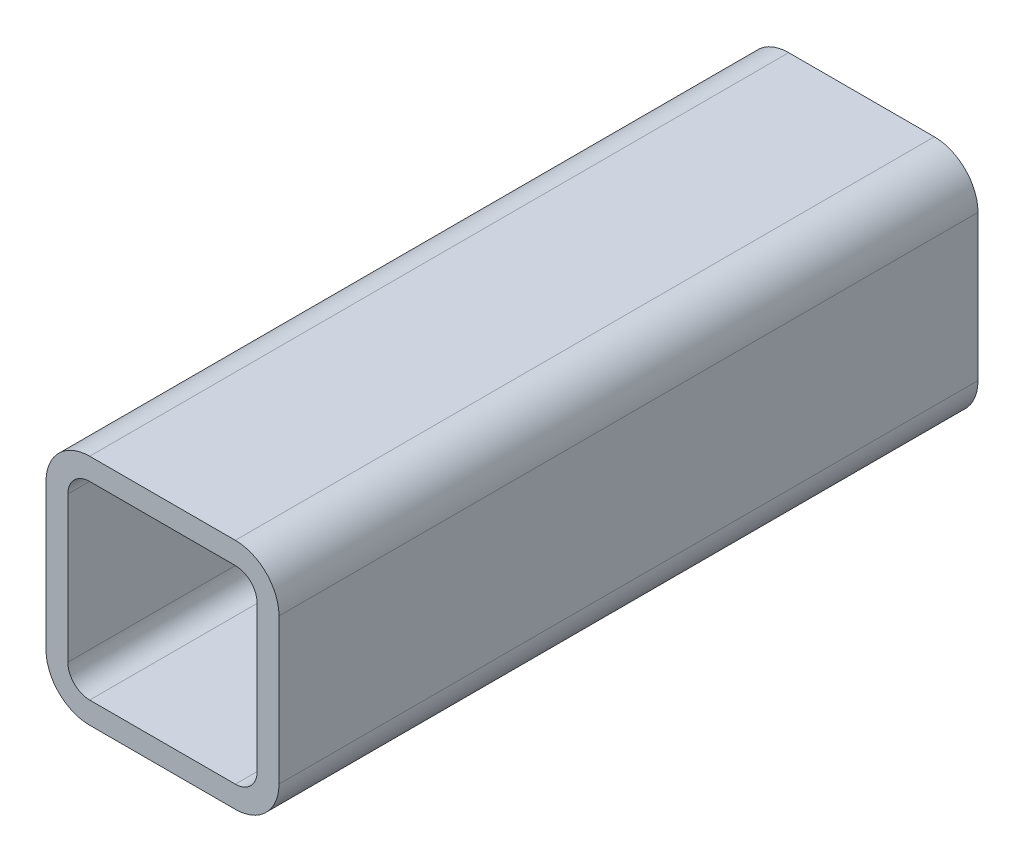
ISO-10303-21;
HEADER;
FILE_DESCRIPTION(('STEP AP214'),'2;1');
FILE_NAME('part.step','',(''),(''),'','','');
FILE_SCHEMA(('AUTOMOTIVE_DESIGN { 1 0 10303 214 1 1 1 1 }'));
ENDSEC;
DATA;
#1=APPLICATION_CONTEXT('core data for automotive mechanical design processes');
#2=APPLICATION_PROTOCOL_DEFINITION('international standard','automotive_design',2000,#1);
#3=PRODUCT_CONTEXT('',#1,'mechanical');
#4=PRODUCT('Part','Part','',(#3));
#5=PRODUCT_RELATED_PRODUCT_CATEGORY('part','',(#4));
#6=PRODUCT_DEFINITION_FORMATION('','',#4);
#7=PRODUCT_DEFINITION_CONTEXT('part definition',#1,'design');
#8=PRODUCT_DEFINITION('design','',#6,#7);
#9=PRODUCT_DEFINITION_SHAPE('','',#8);
#10=(LENGTH_UNIT() NAMED_UNIT(*) SI_UNIT(.MILLI.,.METRE.));
#11=(NAMED_UNIT(*) PLANE_ANGLE_UNIT() SI_UNIT($,.RADIAN.));
#12=(NAMED_UNIT(*) SI_UNIT($,.STERADIAN.) SOLID_ANGLE_UNIT());
#13=UNCERTAINTY_MEASURE_WITH_UNIT(LENGTH_MEASURE(1.E-05),#10,'distance_accuracy_value','');
#14=(GEOMETRIC_REPRESENTATION_CONTEXT(3) GLOBAL_UNCERTAINTY_ASSIGNED_CONTEXT((#13)) GLOBAL_UNIT_ASSIGNED_CONTEXT((#10,
#11,#12)) REPRESENTATION_CONTEXT('',''));
#15=CARTESIAN_POINT('',(0.,0.,0.));
#16=DIRECTION('',(0.,0.,1.));
#17=DIRECTION('',(1.,0.,0.));
#18=AXIS2_PLACEMENT_3D('',#15,#16,#17);
#19=CARTESIAN_POINT('',(20.7251778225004,84.6077651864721,304.8));
#20=DIRECTION('',(0.,0.,1.));
#21=DIRECTION('',(1.,0.,0.));
#22=AXIS2_PLACEMENT_3D('',#19,#20,#21);
#23=PLANE('',#22);
#24=CARTESIAN_POINT('',(20.7251778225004,84.6077651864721,304.8));
#25=DIRECTION('',(0.,0.,1.));
#26=DIRECTION('',(1.,0.,0.));
#27=AXIS2_PLACEMENT_3D('',#24,#25,#26);
#28=CIRCLE('',#27,19.05);
#29=CARTESIAN_POINT('',(20.7251778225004,103.657765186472,304.8));
#30=VERTEX_POINT('',#29);
#31=CARTESIAN_POINT('',(1.67517782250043,84.6077651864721,304.8));
#32=VERTEX_POINT('',#31);
#33=EDGE_CURVE('E211',#30,#32,#28,.T.);
#34=ORIENTED_EDGE('',*,*,#33,.T.);
#35=DIRECTION('',(0.,-1.,0.));
#36=VECTOR('',#35,1.);
#37=CARTESIAN_POINT('',(1.67517782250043,21.1077651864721,304.8));
#38=LINE('',#37,#36);
#39=CARTESIAN_POINT('',(1.67517782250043,21.1077651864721,304.8));
#40=VERTEX_POINT('',#39);
#41=EDGE_CURVE('E214',#32,#40,#38,.T.);
#42=ORIENTED_EDGE('',*,*,#41,.T.);
#43=CARTESIAN_POINT('',(20.7251778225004,21.1077651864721,304.8));
#44=DIRECTION('',(0.,0.,1.));
#45=DIRECTION('',(1.,0.,0.));
#46=AXIS2_PLACEMENT_3D('',#43,#44,#45);
#47=CIRCLE('',#46,19.05);
#48=CARTESIAN_POINT('',(20.7251778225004,2.05776518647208,304.8));
#49=VERTEX_POINT('',#48);
#50=EDGE_CURVE('E217',#40,#49,#47,.T.);
#51=ORIENTED_EDGE('',*,*,#50,.T.);
#52=DIRECTION('',(1.,0.,0.));
#53=VECTOR('',#52,1.);
#54=CARTESIAN_POINT('',(84.2251778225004,2.05776518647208,304.8));
#55=LINE('',#54,#53);
#56=CARTESIAN_POINT('',(84.2251778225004,2.05776518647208,304.8));
#57=VERTEX_POINT('',#56);
#58=EDGE_CURVE('E219',#49,#57,#55,.T.);
#59=ORIENTED_EDGE('',*,*,#58,.T.);
#60=CARTESIAN_POINT('',(84.2251778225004,21.1077651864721,304.8));
#61=DIRECTION('',(0.,0.,1.));
#62=DIRECTION('',(1.,0.,0.));
#63=AXIS2_PLACEMENT_3D('',#60,#61,#62);
#64=CIRCLE('',#63,19.05);
#65=CARTESIAN_POINT('',(103.2751778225,21.1077651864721,304.8));
#66=VERTEX_POINT('',#65);
#67=EDGE_CURVE('E221',#57,#66,#64,.T.);
#68=ORIENTED_EDGE('',*,*,#67,.T.);
#69=DIRECTION('',(0.,1.,0.));
#70=VECTOR('',#69,1.);
#71=CARTESIAN_POINT('',(103.2751778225,84.6077651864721,304.8));
#72=LINE('',#71,#70);
#73=CARTESIAN_POINT('',(103.2751778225,84.6077651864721,304.8));
#74=VERTEX_POINT('',#73);
#75=EDGE_CURVE('E223',#66,#74,#72,.T.);
#76=ORIENTED_EDGE('',*,*,#75,.T.);
#77=CARTESIAN_POINT('',(84.2251778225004,84.6077651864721,304.8));
#78=DIRECTION('',(0.,0.,1.));
#79=DIRECTION('',(1.,0.,0.));
#80=AXIS2_PLACEMENT_3D('',#77,#78,#79);
#81=CIRCLE('',#80,19.05);
#82=CARTESIAN_POINT('',(84.2251778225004,103.657765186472,304.8));
#83=VERTEX_POINT('',#82);
#84=EDGE_CURVE('E225',#74,#83,#81,.T.);
#85=ORIENTED_EDGE('',*,*,#84,.T.);
#86=DIRECTION('',(-1.,0.,0.));
#87=VECTOR('',#86,1.);
#88=CARTESIAN_POINT('',(20.7251778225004,103.657765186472,304.8));
#89=LINE('',#88,#87);
#90=EDGE_CURVE('E227',#83,#30,#89,.T.);
#91=ORIENTED_EDGE('',*,*,#90,.T.);
#92=EDGE_LOOP('',(#34,#42,#51,#59,#68,#76,#85,#91));
#93=FACE_BOUND('',#92,.T.);
#94=DIRECTION('',(0.,-1.,0.));
#95=VECTOR('',#94,1.);
#96=CARTESIAN_POINT('',(11.2001778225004,21.1077651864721,304.8));
#97=LINE('',#96,#95);
#98=CARTESIAN_POINT('',(11.2001778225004,84.6077651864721,304.8));
#99=VERTEX_POINT('',#98);
#100=CARTESIAN_POINT('',(11.2001778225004,21.1077651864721,304.8));
#101=VERTEX_POINT('',#100);
#102=EDGE_CURVE('E154',#99,#101,#97,.T.);
#103=ORIENTED_EDGE('',*,*,#102,.F.);
#104=CARTESIAN_POINT('',(20.7251778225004,84.6077651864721,304.8));
#105=DIRECTION('',(0.,0.,1.));
#106=DIRECTION('',(1.,0.,0.));
#107=AXIS2_PLACEMENT_3D('',#104,#105,#106);
#108=CIRCLE('',#107,9.52500000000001);
#109=CARTESIAN_POINT('',(20.7251778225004,94.1327651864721,304.8));
#110=VERTEX_POINT('',#109);
#111=EDGE_CURVE('E146',#110,#99,#108,.T.);
#112=ORIENTED_EDGE('',*,*,#111,.F.);
#113=DIRECTION('',(-1.,0.,0.));
#114=VECTOR('',#113,1.);
#115=CARTESIAN_POINT('',(20.7251778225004,94.1327651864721,304.8));
#116=LINE('',#115,#114);
#117=CARTESIAN_POINT('',(84.2251778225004,94.1327651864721,304.8));
#118=VERTEX_POINT('',#117);
#119=EDGE_CURVE('E179',#118,#110,#116,.T.);
#120=ORIENTED_EDGE('',*,*,#119,.F.);
#121=CARTESIAN_POINT('',(84.2251778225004,84.6077651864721,304.8));
#122=DIRECTION('',(0.,0.,1.));
#123=DIRECTION('',(1.,0.,0.));
#124=AXIS2_PLACEMENT_3D('',#121,#122,#123);
#125=CIRCLE('',#124,9.52500000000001);
#126=CARTESIAN_POINT('',(93.7501778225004,84.6077651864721,304.8));
#127=VERTEX_POINT('',#126);
#128=EDGE_CURVE('E177',#127,#118,#125,.T.);
#129=ORIENTED_EDGE('',*,*,#128,.F.);
#130=DIRECTION('',(0.,1.,0.));
#131=VECTOR('',#130,1.);
#132=CARTESIAN_POINT('',(93.7501778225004,84.6077651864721,304.8));
#133=LINE('',#132,#131);
#134=CARTESIAN_POINT('',(93.7501778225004,21.1077651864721,304.8));
#135=VERTEX_POINT('',#134);
#136=EDGE_CURVE('E175',#135,#127,#133,.T.);
#137=ORIENTED_EDGE('',*,*,#136,.F.);
#138=CARTESIAN_POINT('',(84.2251778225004,21.1077651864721,304.8));
#139=DIRECTION('',(0.,0.,1.));
#140=DIRECTION('',(1.,0.,0.));
#141=AXIS2_PLACEMENT_3D('',#138,#139,#140);
#142=CIRCLE('',#141,9.52500000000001);
#143=CARTESIAN_POINT('',(84.2251778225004,11.5827651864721,304.8));
#144=VERTEX_POINT('',#143);
#145=EDGE_CURVE('E173',#144,#135,#142,.T.);
#146=ORIENTED_EDGE('',*,*,#145,.F.);
#147=DIRECTION('',(1.,0.,0.));
#148=VECTOR('',#147,1.);
#149=CARTESIAN_POINT('',(84.2251778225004,11.5827651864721,304.8));
#150=LINE('',#149,#148);
#151=CARTESIAN_POINT('',(20.7251778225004,11.5827651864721,304.8));
#152=VERTEX_POINT('',#151);
#153=EDGE_CURVE('E169',#152,#144,#150,.T.);
#154=ORIENTED_EDGE('',*,*,#153,.F.);
#155=CARTESIAN_POINT('',(20.7251778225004,21.1077651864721,304.8));
#156=DIRECTION('',(0.,0.,1.));
#157=DIRECTION('',(1.,0.,0.));
#158=AXIS2_PLACEMENT_3D('',#155,#156,#157);
#159=CIRCLE('',#158,9.525);
#160=EDGE_CURVE('E167',#101,#152,#159,.T.);
#161=ORIENTED_EDGE('',*,*,#160,.F.);
#162=EDGE_LOOP('',(#103,#112,#120,#129,#137,#146,#154,#161));
#163=FACE_BOUND('',#162,.T.);
#164=ADVANCED_FACE('F33',(#93,#163),#23,.T.);
#165=CARTESIAN_POINT('',(20.7251778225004,84.6077651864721,0.));
#166=DIRECTION('',(0.,0.,1.));
#167=DIRECTION('',(1.,0.,0.));
#168=AXIS2_PLACEMENT_3D('',#165,#166,#167);
#169=PLANE('',#168);
#170=CARTESIAN_POINT('',(20.7251778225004,84.6077651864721,0.));
#171=DIRECTION('',(0.,0.,1.));
#172=DIRECTION('',(1.,0.,0.));
#173=AXIS2_PLACEMENT_3D('',#170,#171,#172);
#174=CIRCLE('',#173,19.05);
#175=CARTESIAN_POINT('',(20.7251778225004,103.657765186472,0.));
#176=VERTEX_POINT('',#175);
#177=CARTESIAN_POINT('',(1.67517782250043,84.6077651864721,0.));
#178=VERTEX_POINT('',#177);
#179=EDGE_CURVE('E162',#176,#178,#174,.T.);
#180=ORIENTED_EDGE('',*,*,#179,.F.);
#181=DIRECTION('',(-1.,0.,0.));
#182=VECTOR('',#181,1.);
#183=CARTESIAN_POINT('',(20.7251778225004,103.657765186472,0.));
#184=LINE('',#183,#182);
#185=CARTESIAN_POINT('',(84.2251778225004,103.657765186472,0.));
#186=VERTEX_POINT('',#185);
#187=EDGE_CURVE('E215',#186,#176,#184,.T.);
#188=ORIENTED_EDGE('',*,*,#187,.F.);
#189=CARTESIAN_POINT('',(84.2251778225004,84.6077651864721,0.));
#190=DIRECTION('',(0.,0.,1.));
#191=DIRECTION('',(1.,0.,0.));
#192=AXIS2_PLACEMENT_3D('',#189,#190,#191);
#193=CIRCLE('',#192,19.05);
#194=CARTESIAN_POINT('',(103.2751778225,84.6077651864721,0.));
#195=VERTEX_POINT('',#194);
#196=EDGE_CURVE('E242',#195,#186,#193,.T.);
#197=ORIENTED_EDGE('',*,*,#196,.F.);
#198=DIRECTION('',(0.,1.,0.));
#199=VECTOR('',#198,1.);
#200=CARTESIAN_POINT('',(103.2751778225,84.6077651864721,0.));
#201=LINE('',#200,#199);
#202=CARTESIAN_POINT('',(103.2751778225,21.1077651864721,0.));
#203=VERTEX_POINT('',#202);
#204=EDGE_CURVE('E240',#203,#195,#201,.T.);
#205=ORIENTED_EDGE('',*,*,#204,.F.);
#206=CARTESIAN_POINT('',(84.2251778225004,21.1077651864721,0.));
#207=DIRECTION('',(0.,0.,1.));
#208=DIRECTION('',(1.,0.,0.));
#209=AXIS2_PLACEMENT_3D('',#206,#207,#208);
#210=CIRCLE('',#209,19.05);
#211=CARTESIAN_POINT('',(84.2251778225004,2.05776518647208,0.));
#212=VERTEX_POINT('',#211);
#213=EDGE_CURVE('E238',#212,#203,#210,.T.);
#214=ORIENTED_EDGE('',*,*,#213,.F.);
#215=DIRECTION('',(1.,0.,0.));
#216=VECTOR('',#215,1.);
#217=CARTESIAN_POINT('',(84.2251778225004,2.05776518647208,0.));
#218=LINE('',#217,#216);
#219=CARTESIAN_POINT('',(20.7251778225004,2.05776518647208,0.));
#220=VERTEX_POINT('',#219);
#221=EDGE_CURVE('E236',#220,#212,#218,.T.);
#222=ORIENTED_EDGE('',*,*,#221,.F.);
#223=CARTESIAN_POINT('',(20.7251778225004,21.1077651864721,0.));
#224=DIRECTION('',(0.,0.,1.));
#225=DIRECTION('',(1.,0.,0.));
#226=AXIS2_PLACEMENT_3D('',#223,#224,#225);
#227=CIRCLE('',#226,19.05);
#228=CARTESIAN_POINT('',(1.67517782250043,21.1077651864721,0.));
#229=VERTEX_POINT('',#228);
#230=EDGE_CURVE('E234',#229,#220,#227,.T.);
#231=ORIENTED_EDGE('',*,*,#230,.F.);
#232=DIRECTION('',(0.,-1.,0.));
#233=VECTOR('',#232,1.);
#234=CARTESIAN_POINT('',(1.67517782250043,21.1077651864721,0.));
#235=LINE('',#234,#233);
#236=EDGE_CURVE('E232',#178,#229,#235,.T.);
#237=ORIENTED_EDGE('',*,*,#236,.F.);
#238=EDGE_LOOP('',(#180,#188,#197,#205,#214,#222,#231,#237));
#239=FACE_BOUND('',#238,.T.);
#240=CARTESIAN_POINT('',(20.7251778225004,84.6077651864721,0.));
#241=DIRECTION('',(0.,0.,1.));
#242=DIRECTION('',(1.,0.,0.));
#243=AXIS2_PLACEMENT_3D('',#240,#241,#242);
#244=CIRCLE('',#243,9.52500000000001);
#245=CARTESIAN_POINT('',(20.7251778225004,94.1327651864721,0.));
#246=VERTEX_POINT('',#245);
#247=CARTESIAN_POINT('',(11.2001778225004,84.6077651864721,0.));
#248=VERTEX_POINT('',#247);
#249=EDGE_CURVE('E56',#246,#248,#244,.T.);
#250=ORIENTED_EDGE('',*,*,#249,.T.);
#251=DIRECTION('',(0.,-1.,0.));
#252=VECTOR('',#251,1.);
#253=CARTESIAN_POINT('',(11.2001778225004,21.1077651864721,0.));
#254=LINE('',#253,#252);
#255=CARTESIAN_POINT('',(11.2001778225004,21.1077651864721,0.));
#256=VERTEX_POINT('',#255);
#257=EDGE_CURVE('E161',#248,#256,#254,.T.);
#258=ORIENTED_EDGE('',*,*,#257,.T.);
#259=CARTESIAN_POINT('',(20.7251778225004,21.1077651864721,0.));
#260=DIRECTION('',(0.,0.,1.));
#261=DIRECTION('',(1.,0.,0.));
#262=AXIS2_PLACEMENT_3D('',#259,#260,#261);
#263=CIRCLE('',#262,9.525);
#264=CARTESIAN_POINT('',(20.7251778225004,11.5827651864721,0.));
#265=VERTEX_POINT('',#264);
#266=EDGE_CURVE('E183',#256,#265,#263,.T.);
#267=ORIENTED_EDGE('',*,*,#266,.T.);
#268=DIRECTION('',(1.,0.,0.));
#269=VECTOR('',#268,1.);
#270=CARTESIAN_POINT('',(84.2251778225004,11.5827651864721,0.));
#271=LINE('',#270,#269);
#272=CARTESIAN_POINT('',(84.2251778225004,11.5827651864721,0.));
#273=VERTEX_POINT('',#272);
#274=EDGE_CURVE('E186',#265,#273,#271,.T.);
#275=ORIENTED_EDGE('',*,*,#274,.T.);
#276=CARTESIAN_POINT('',(84.2251778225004,21.1077651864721,0.));
#277=DIRECTION('',(0.,0.,1.));
#278=DIRECTION('',(1.,0.,0.));
#279=AXIS2_PLACEMENT_3D('',#276,#277,#278);
#280=CIRCLE('',#279,9.52500000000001);
#281=CARTESIAN_POINT('',(93.7501778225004,21.1077651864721,0.));
#282=VERTEX_POINT('',#281);
#283=EDGE_CURVE('E189',#273,#282,#280,.T.);
#284=ORIENTED_EDGE('',*,*,#283,.T.);
#285=DIRECTION('',(0.,1.,0.));
#286=VECTOR('',#285,1.);
#287=CARTESIAN_POINT('',(93.7501778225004,84.6077651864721,0.));
#288=LINE('',#287,#286);
#289=CARTESIAN_POINT('',(93.7501778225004,84.6077651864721,0.));
#290=VERTEX_POINT('',#289);
#291=EDGE_CURVE('E192',#282,#290,#288,.T.);
#292=ORIENTED_EDGE('',*,*,#291,.T.);
#293=CARTESIAN_POINT('',(84.2251778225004,84.6077651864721,0.));
#294=DIRECTION('',(0.,0.,1.));
#295=DIRECTION('',(1.,0.,0.));
#296=AXIS2_PLACEMENT_3D('',#293,#294,#295);
#297=CIRCLE('',#296,9.52500000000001);
#298=CARTESIAN_POINT('',(84.2251778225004,94.1327651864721,0.));
#299=VERTEX_POINT('',#298);
#300=EDGE_CURVE('E195',#290,#299,#297,.T.);
#301=ORIENTED_EDGE('',*,*,#300,.T.);
#302=DIRECTION('',(-1.,0.,0.));
#303=VECTOR('',#302,1.);
#304=CARTESIAN_POINT('',(20.7251778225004,94.1327651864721,0.));
#305=LINE('',#304,#303);
#306=EDGE_CURVE('E155',#299,#246,#305,.T.);
#307=ORIENTED_EDGE('',*,*,#306,.T.);
#308=EDGE_LOOP('',(#250,#258,#267,#275,#284,#292,#301,#307));
#309=FACE_BOUND('',#308,.T.);
#310=ADVANCED_FACE('F272',(#239,#309),#169,.F.);
#311=CARTESIAN_POINT('',(20.7251778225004,84.6077651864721,304.8));
#312=DIRECTION('',(0.,0.,-1.));
#313=DIRECTION('',(-1.,0.,0.));
#314=AXIS2_PLACEMENT_3D('',#311,#312,#313);
#315=CYLINDRICAL_SURFACE('',#314,19.05);
#316=ORIENTED_EDGE('',*,*,#179,.T.);
#317=DIRECTION('',(0.,0.,-1.));
#318=VECTOR('',#317,1.);
#319=CARTESIAN_POINT('',(1.67517782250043,84.6077651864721,304.8));
#320=LINE('',#319,#318);
#321=EDGE_CURVE('E11',#32,#178,#320,.T.);
#322=ORIENTED_EDGE('',*,*,#321,.F.);
#323=ORIENTED_EDGE('',*,*,#33,.F.);
#324=DIRECTION('',(0.,0.,-1.));
#325=VECTOR('',#324,1.);
#326=CARTESIAN_POINT('',(20.7251778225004,103.657765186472,304.8));
#327=LINE('',#326,#325);
#328=EDGE_CURVE('E229',#30,#176,#327,.T.);
#329=ORIENTED_EDGE('',*,*,#328,.T.);
#330=EDGE_LOOP('',(#316,#322,#323,#329));
#331=FACE_BOUND('',#330,.T.);
#332=ADVANCED_FACE('F35',(#331),#315,.T.);
#333=CARTESIAN_POINT('',(1.67517782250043,21.1077651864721,304.8));
#334=DIRECTION('',(1.,0.,0.));
#335=DIRECTION('',(0.,0.,-1.));
#336=AXIS2_PLACEMENT_3D('',#333,#334,#335);
#337=PLANE('',#336);
#338=ORIENTED_EDGE('',*,*,#236,.T.);
#339=DIRECTION('',(0.,0.,-1.));
#340=VECTOR('',#339,1.);
#341=CARTESIAN_POINT('',(1.67517782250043,21.1077651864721,304.8));
#342=LINE('',#341,#340);
#343=EDGE_CURVE('E41',#40,#229,#342,.T.);
#344=ORIENTED_EDGE('',*,*,#343,.F.);
#345=ORIENTED_EDGE('',*,*,#41,.F.);
#346=ORIENTED_EDGE('',*,*,#321,.T.);
#347=EDGE_LOOP('',(#338,#344,#345,#346));
#348=FACE_BOUND('',#347,.T.);
#349=ADVANCED_FACE('F289',(#348),#337,.F.);
#350=CARTESIAN_POINT('',(20.7251778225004,21.1077651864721,304.8));
#351=DIRECTION('',(0.,0.,-1.));
#352=DIRECTION('',(-1.,0.,0.));
#353=AXIS2_PLACEMENT_3D('',#350,#351,#352);
#354=CYLINDRICAL_SURFACE('',#353,19.05);
#355=ORIENTED_EDGE('',*,*,#230,.T.);
#356=DIRECTION('',(0.,0.,-1.));
#357=VECTOR('',#356,1.);
#358=CARTESIAN_POINT('',(20.7251778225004,2.05776518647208,304.8));
#359=LINE('',#358,#357);
#360=EDGE_CURVE('E259',#49,#220,#359,.T.);
#361=ORIENTED_EDGE('',*,*,#360,.F.);
#362=ORIENTED_EDGE('',*,*,#50,.F.);
#363=ORIENTED_EDGE('',*,*,#343,.T.);
#364=EDGE_LOOP('',(#355,#361,#362,#363));
#365=FACE_BOUND('',#364,.T.);
#366=ADVANCED_FACE('F266',(#365),#354,.T.);
#367=CARTESIAN_POINT('',(84.2251778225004,2.05776518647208,304.8));
#368=DIRECTION('',(0.,1.,0.));
#369=DIRECTION('',(0.,0.,1.));
#370=AXIS2_PLACEMENT_3D('',#367,#368,#369);
#371=PLANE('',#370);
#372=ORIENTED_EDGE('',*,*,#221,.T.);
#373=DIRECTION('',(0.,0.,-1.));
#374=VECTOR('',#373,1.);
#375=CARTESIAN_POINT('',(84.2251778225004,2.05776518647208,304.8));
#376=LINE('',#375,#374);
#377=EDGE_CURVE('E256',#57,#212,#376,.T.);
#378=ORIENTED_EDGE('',*,*,#377,.F.);
#379=ORIENTED_EDGE('',*,*,#58,.F.);
#380=ORIENTED_EDGE('',*,*,#360,.T.);
#381=EDGE_LOOP('',(#372,#378,#379,#380));
#382=FACE_BOUND('',#381,.T.);
#383=ADVANCED_FACE('F278',(#382),#371,.F.);
#384=CARTESIAN_POINT('',(84.2251778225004,21.1077651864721,304.8));
#385=DIRECTION('',(0.,0.,-1.));
#386=DIRECTION('',(-1.,0.,0.));
#387=AXIS2_PLACEMENT_3D('',#384,#385,#386);
#388=CYLINDRICAL_SURFACE('',#387,19.05);
#389=ORIENTED_EDGE('',*,*,#213,.T.);
#390=DIRECTION('',(0.,0.,-1.));
#391=VECTOR('',#390,1.);
#392=CARTESIAN_POINT('',(103.2751778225,21.1077651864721,304.8));
#393=LINE('',#392,#391);
#394=EDGE_CURVE('E253',#66,#203,#393,.T.);
#395=ORIENTED_EDGE('',*,*,#394,.F.);
#396=ORIENTED_EDGE('',*,*,#67,.F.);
#397=ORIENTED_EDGE('',*,*,#377,.T.);
#398=EDGE_LOOP('',(#389,#395,#396,#397));
#399=FACE_BOUND('',#398,.T.);
#400=ADVANCED_FACE('F282',(#399),#388,.T.);
#401=CARTESIAN_POINT('',(103.2751778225,84.6077651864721,304.8));
#402=DIRECTION('',(-1.,0.,0.));
#403=DIRECTION('',(0.,0.,1.));
#404=AXIS2_PLACEMENT_3D('',#401,#402,#403);
#405=PLANE('',#404);
#406=ORIENTED_EDGE('',*,*,#204,.T.);
#407=DIRECTION('',(0.,0.,-1.));
#408=VECTOR('',#407,1.);
#409=CARTESIAN_POINT('',(103.2751778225,84.6077651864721,304.8));
#410=LINE('',#409,#408);
#411=EDGE_CURVE('E250',#74,#195,#410,.T.);
#412=ORIENTED_EDGE('',*,*,#411,.F.);
#413=ORIENTED_EDGE('',*,*,#75,.F.);
#414=ORIENTED_EDGE('',*,*,#394,.T.);
#415=EDGE_LOOP('',(#406,#412,#413,#414));
#416=FACE_BOUND('',#415,.T.);
#417=ADVANCED_FACE('F302',(#416),#405,.F.);
#418=CARTESIAN_POINT('',(84.2251778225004,84.6077651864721,304.8));
#419=DIRECTION('',(0.,0.,-1.));
#420=DIRECTION('',(-1.,0.,0.));
#421=AXIS2_PLACEMENT_3D('',#418,#419,#420);
#422=CYLINDRICAL_SURFACE('',#421,19.05);
#423=ORIENTED_EDGE('',*,*,#196,.T.);
#424=DIRECTION('',(0.,0.,-1.));
#425=VECTOR('',#424,1.);
#426=CARTESIAN_POINT('',(84.2251778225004,103.657765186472,304.8));
#427=LINE('',#426,#425);
#428=EDGE_CURVE('E247',#83,#186,#427,.T.);
#429=ORIENTED_EDGE('',*,*,#428,.F.);
#430=ORIENTED_EDGE('',*,*,#84,.F.);
#431=ORIENTED_EDGE('',*,*,#411,.T.);
#432=EDGE_LOOP('',(#423,#429,#430,#431));
#433=FACE_BOUND('',#432,.T.);
#434=ADVANCED_FACE('F300',(#433),#422,.T.);
#435=CARTESIAN_POINT('',(20.7251778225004,103.657765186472,304.8));
#436=DIRECTION('',(0.,-1.,0.));
#437=DIRECTION('',(0.,0.,-1.));
#438=AXIS2_PLACEMENT_3D('',#435,#436,#437);
#439=PLANE('',#438);
#440=ORIENTED_EDGE('',*,*,#187,.T.);
#441=ORIENTED_EDGE('',*,*,#328,.F.);
#442=ORIENTED_EDGE('',*,*,#90,.F.);
#443=ORIENTED_EDGE('',*,*,#428,.T.);
#444=EDGE_LOOP('',(#440,#441,#442,#443));
#445=FACE_BOUND('',#444,.T.);
#446=ADVANCED_FACE('F295',(#445),#439,.F.);
#447=CARTESIAN_POINT('',(20.7251778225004,84.6077651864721,304.8));
#448=DIRECTION('',(0.,0.,-1.));
#449=DIRECTION('',(-1.,0.,0.));
#450=AXIS2_PLACEMENT_3D('',#447,#448,#449);
#451=CYLINDRICAL_SURFACE('',#450,9.52500000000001);
#452=ORIENTED_EDGE('',*,*,#249,.F.);
#453=DIRECTION('',(0.,0.,-1.));
#454=VECTOR('',#453,1.);
#455=CARTESIAN_POINT('',(20.7251778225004,94.1327651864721,304.8));
#456=LINE('',#455,#454);
#457=EDGE_CURVE('E150',#110,#246,#456,.T.);
#458=ORIENTED_EDGE('',*,*,#457,.F.);
#459=ORIENTED_EDGE('',*,*,#111,.T.);
#460=DIRECTION('',(0.,0.,-1.));
#461=VECTOR('',#460,1.);
#462=CARTESIAN_POINT('',(11.2001778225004,84.6077651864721,304.8));
#463=LINE('',#462,#461);
#464=EDGE_CURVE('E149',#99,#248,#463,.T.);
#465=ORIENTED_EDGE('',*,*,#464,.T.);
#466=EDGE_LOOP('',(#452,#458,#459,#465));
#467=FACE_BOUND('',#466,.T.);
#468=ADVANCED_FACE('F148',(#467),#451,.F.);
#469=CARTESIAN_POINT('',(11.2001778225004,21.1077651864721,304.8));
#470=DIRECTION('',(1.,0.,0.));
#471=DIRECTION('',(0.,0.,-1.));
#472=AXIS2_PLACEMENT_3D('',#469,#470,#471);
#473=PLANE('',#472);
#474=ORIENTED_EDGE('',*,*,#257,.F.);
#475=ORIENTED_EDGE('',*,*,#464,.F.);
#476=ORIENTED_EDGE('',*,*,#102,.T.);
#477=DIRECTION('',(0.,0.,-1.));
#478=VECTOR('',#477,1.);
#479=CARTESIAN_POINT('',(11.2001778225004,21.1077651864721,304.8));
#480=LINE('',#479,#478);
#481=EDGE_CURVE('E163',#101,#256,#480,.T.);
#482=ORIENTED_EDGE('',*,*,#481,.T.);
#483=EDGE_LOOP('',(#474,#475,#476,#482));
#484=FACE_BOUND('',#483,.T.);
#485=ADVANCED_FACE('F158',(#484),#473,.T.);
#486=CARTESIAN_POINT('',(20.7251778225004,21.1077651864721,304.8));
#487=DIRECTION('',(0.,0.,-1.));
#488=DIRECTION('',(-1.,0.,0.));
#489=AXIS2_PLACEMENT_3D('',#486,#487,#488);
#490=CYLINDRICAL_SURFACE('',#489,9.525);
#491=ORIENTED_EDGE('',*,*,#266,.F.);
#492=ORIENTED_EDGE('',*,*,#481,.F.);
#493=ORIENTED_EDGE('',*,*,#160,.T.);
#494=DIRECTION('',(0.,0.,-1.));
#495=VECTOR('',#494,1.);
#496=CARTESIAN_POINT('',(20.7251778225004,11.5827651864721,304.8));
#497=LINE('',#496,#495);
#498=EDGE_CURVE('E208',#152,#265,#497,.T.);
#499=ORIENTED_EDGE('',*,*,#498,.T.);
#500=EDGE_LOOP('',(#491,#492,#493,#499));
#501=FACE_BOUND('',#500,.T.);
#502=ADVANCED_FACE('F327',(#501),#490,.F.);
#503=CARTESIAN_POINT('',(84.2251778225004,11.5827651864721,304.8));
#504=DIRECTION('',(0.,1.,0.));
#505=DIRECTION('',(0.,0.,1.));
#506=AXIS2_PLACEMENT_3D('',#503,#504,#505);
#507=PLANE('',#506);
#508=ORIENTED_EDGE('',*,*,#274,.F.);
#509=ORIENTED_EDGE('',*,*,#498,.F.);
#510=ORIENTED_EDGE('',*,*,#153,.T.);
#511=DIRECTION('',(0.,0.,-1.));
#512=VECTOR('',#511,1.);
#513=CARTESIAN_POINT('',(84.2251778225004,11.5827651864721,304.8));
#514=LINE('',#513,#512);
#515=EDGE_CURVE('E206',#144,#273,#514,.T.);
#516=ORIENTED_EDGE('',*,*,#515,.T.);
#517=EDGE_LOOP('',(#508,#509,#510,#516));
#518=FACE_BOUND('',#517,.T.);
#519=ADVANCED_FACE('F331',(#518),#507,.T.);
#520=CARTESIAN_POINT('',(84.2251778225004,21.1077651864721,304.8));
#521=DIRECTION('',(0.,0.,-1.));
#522=DIRECTION('',(-1.,0.,0.));
#523=AXIS2_PLACEMENT_3D('',#520,#521,#522);
#524=CYLINDRICAL_SURFACE('',#523,9.52500000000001);
#525=ORIENTED_EDGE('',*,*,#283,.F.);
#526=ORIENTED_EDGE('',*,*,#515,.F.);
#527=ORIENTED_EDGE('',*,*,#145,.T.);
#528=DIRECTION('',(0.,0.,-1.));
#529=VECTOR('',#528,1.);
#530=CARTESIAN_POINT('',(93.7501778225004,21.1077651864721,304.8));
#531=LINE('',#530,#529);
#532=EDGE_CURVE('E204',#135,#282,#531,.T.);
#533=ORIENTED_EDGE('',*,*,#532,.T.);
#534=EDGE_LOOP('',(#525,#526,#527,#533));
#535=FACE_BOUND('',#534,.T.);
#536=ADVANCED_FACE('F337',(#535),#524,.F.);
#537=CARTESIAN_POINT('',(93.7501778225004,84.6077651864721,304.8));
#538=DIRECTION('',(-1.,0.,0.));
#539=DIRECTION('',(0.,0.,1.));
#540=AXIS2_PLACEMENT_3D('',#537,#538,#539);
#541=PLANE('',#540);
#542=ORIENTED_EDGE('',*,*,#291,.F.);
#543=ORIENTED_EDGE('',*,*,#532,.F.);
#544=ORIENTED_EDGE('',*,*,#136,.T.);
#545=DIRECTION('',(0.,0.,-1.));
#546=VECTOR('',#545,1.);
#547=CARTESIAN_POINT('',(93.7501778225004,84.6077651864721,304.8));
#548=LINE('',#547,#546);
#549=EDGE_CURVE('E202',#127,#290,#548,.T.);
#550=ORIENTED_EDGE('',*,*,#549,.T.);
#551=EDGE_LOOP('',(#542,#543,#544,#550));
#552=FACE_BOUND('',#551,.T.);
#553=ADVANCED_FACE('F341',(#552),#541,.T.);
#554=CARTESIAN_POINT('',(84.2251778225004,84.6077651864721,304.8));
#555=DIRECTION('',(0.,0.,-1.));
#556=DIRECTION('',(-1.,0.,0.));
#557=AXIS2_PLACEMENT_3D('',#554,#555,#556);
#558=CYLINDRICAL_SURFACE('',#557,9.52500000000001);
#559=ORIENTED_EDGE('',*,*,#300,.F.);
#560=ORIENTED_EDGE('',*,*,#549,.F.);
#561=ORIENTED_EDGE('',*,*,#128,.T.);
#562=DIRECTION('',(0.,0.,-1.));
#563=VECTOR('',#562,1.);
#564=CARTESIAN_POINT('',(84.2251778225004,94.1327651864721,304.8));
#565=LINE('',#564,#563);
#566=EDGE_CURVE('E48',#118,#299,#565,.T.);
#567=ORIENTED_EDGE('',*,*,#566,.T.);
#568=EDGE_LOOP('',(#559,#560,#561,#567));
#569=FACE_BOUND('',#568,.T.);
#570=ADVANCED_FACE('F345',(#569),#558,.F.);
#571=CARTESIAN_POINT('',(20.7251778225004,94.1327651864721,304.8));
#572=DIRECTION('',(0.,-1.,0.));
#573=DIRECTION('',(0.,0.,-1.));
#574=AXIS2_PLACEMENT_3D('',#571,#572,#573);
#575=PLANE('',#574);
#576=ORIENTED_EDGE('',*,*,#306,.F.);
#577=ORIENTED_EDGE('',*,*,#566,.F.);
#578=ORIENTED_EDGE('',*,*,#119,.T.);
#579=ORIENTED_EDGE('',*,*,#457,.T.);
#580=EDGE_LOOP('',(#576,#577,#578,#579));
#581=FACE_BOUND('',#580,.T.);
#582=ADVANCED_FACE('F349',(#581),#575,.T.);
#583=CLOSED_SHELL('',(#164,#310,#332,#349,#366,#383,#400,#417,#434,#446,#468,#485,#502,#519,
#536,#553,#570,#582));
#584=MANIFOLD_SOLID_BREP('B2',#583);
#585=ADVANCED_BREP_SHAPE_REPRESENTATION('',(#18,#584),#14);
#586=SHAPE_DEFINITION_REPRESENTATION(#9,#585);
ENDSEC;
END-ISO-10303-21;
